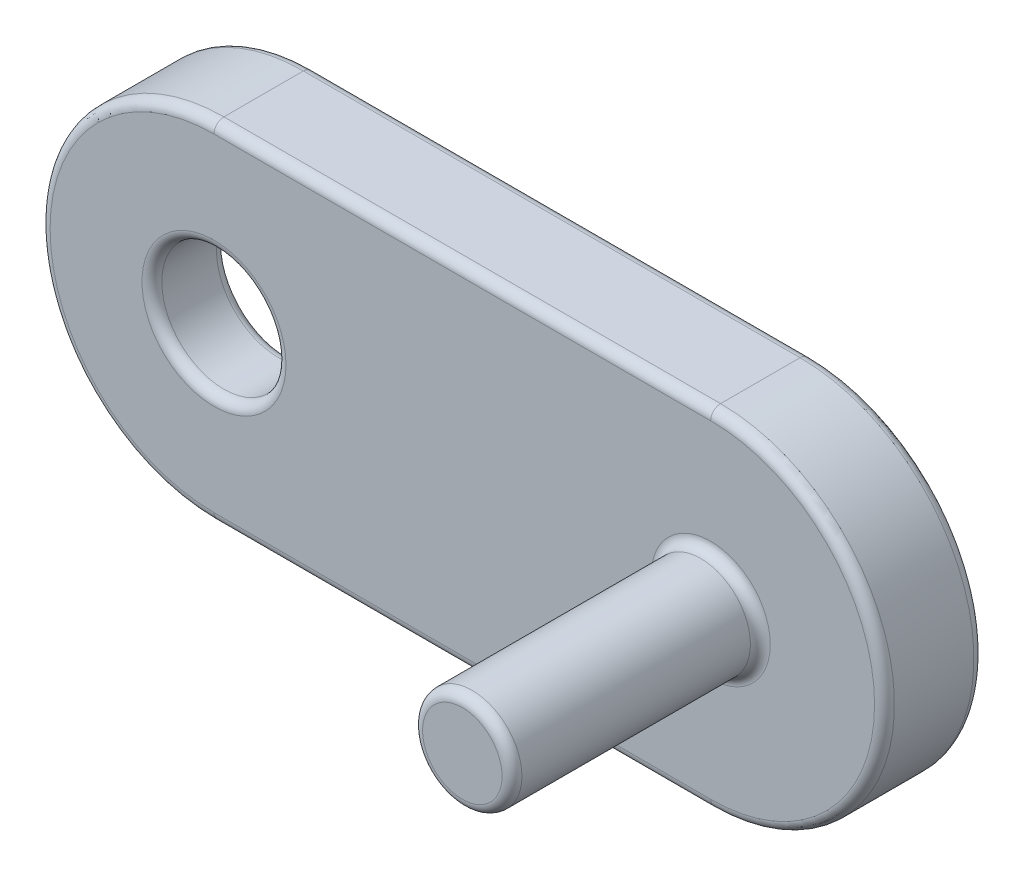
ISO-10303-21;
HEADER;
FILE_DESCRIPTION(('STEP AP214'),'2;1');
FILE_NAME('part.step','',(''),(''),'','','');
FILE_SCHEMA(('AUTOMOTIVE_DESIGN { 1 0 10303 214 1 1 1 1 }'));
ENDSEC;
DATA;
#1=APPLICATION_CONTEXT('core data for automotive mechanical design processes');
#2=APPLICATION_PROTOCOL_DEFINITION('international standard','automotive_design',2000,#1);
#3=PRODUCT_CONTEXT('',#1,'mechanical');
#4=PRODUCT('Part','Part','',(#3));
#5=PRODUCT_RELATED_PRODUCT_CATEGORY('part','',(#4));
#6=PRODUCT_DEFINITION_FORMATION('','',#4);
#7=PRODUCT_DEFINITION_CONTEXT('part definition',#1,'design');
#8=PRODUCT_DEFINITION('design','',#6,#7);
#9=PRODUCT_DEFINITION_SHAPE('','',#8);
#10=(LENGTH_UNIT() NAMED_UNIT(*) SI_UNIT(.MILLI.,.METRE.));
#11=(NAMED_UNIT(*) PLANE_ANGLE_UNIT() SI_UNIT($,.RADIAN.));
#12=(NAMED_UNIT(*) SI_UNIT($,.STERADIAN.) SOLID_ANGLE_UNIT());
#13=UNCERTAINTY_MEASURE_WITH_UNIT(LENGTH_MEASURE(1.E-05),#10,'distance_accuracy_value','');
#14=(GEOMETRIC_REPRESENTATION_CONTEXT(3) GLOBAL_UNCERTAINTY_ASSIGNED_CONTEXT((#13)) GLOBAL_UNIT_ASSIGNED_CONTEXT((#10,
#11,#12)) REPRESENTATION_CONTEXT('',''));
#15=CARTESIAN_POINT('',(0.,0.,0.));
#16=DIRECTION('',(0.,0.,1.));
#17=DIRECTION('',(1.,0.,0.));
#18=AXIS2_PLACEMENT_3D('',#15,#16,#17);
#19=CARTESIAN_POINT('',(-5.,0.,2.));
#20=DIRECTION('',(0.,0.,1.));
#21=DIRECTION('',(1.,0.,0.));
#22=AXIS2_PLACEMENT_3D('',#19,#20,#21);
#23=PLANE('',#22);
#24=CARTESIAN_POINT('',(-5.,0.,2.));
#25=DIRECTION('',(0.,0.,1.));
#26=DIRECTION('',(1.,0.,0.));
#27=AXIS2_PLACEMENT_3D('',#24,#25,#26);
#28=CIRCLE('',#27,1.45);
#29=CARTESIAN_POINT('',(-3.55,0.,2.));
#30=VERTEX_POINT('',#29);
#31=EDGE_CURVE('E243',#30,#30,#28,.F.);
#32=ORIENTED_EDGE('',*,*,#31,.T.);
#33=EDGE_LOOP('',(#32));
#34=FACE_BOUND('',#33,.T.);
#35=CARTESIAN_POINT('',(5.,0.,2.));
#36=DIRECTION('',(0.,0.,1.));
#37=DIRECTION('',(1.,0.,0.));
#38=AXIS2_PLACEMENT_3D('',#35,#36,#37);
#39=CIRCLE('',#38,3.3);
#40=CARTESIAN_POINT('',(5.,-3.3,2.));
#41=VERTEX_POINT('',#40);
#42=CARTESIAN_POINT('',(5.,3.3,2.));
#43=VERTEX_POINT('',#42);
#44=EDGE_CURVE('E46',#41,#43,#39,.T.);
#45=ORIENTED_EDGE('',*,*,#44,.T.);
#46=DIRECTION('',(-1.,0.,0.));
#47=VECTOR('',#46,1.);
#48=CARTESIAN_POINT('',(-5.,3.3,2.));
#49=LINE('',#48,#47);
#50=CARTESIAN_POINT('',(-5.,3.3,2.));
#51=VERTEX_POINT('',#50);
#52=EDGE_CURVE('E241',#43,#51,#49,.T.);
#53=ORIENTED_EDGE('',*,*,#52,.T.);
#54=CARTESIAN_POINT('',(-5.,0.,2.));
#55=DIRECTION('',(0.,0.,1.));
#56=DIRECTION('',(1.,0.,0.));
#57=AXIS2_PLACEMENT_3D('',#54,#55,#56);
#58=CIRCLE('',#57,3.3);
#59=CARTESIAN_POINT('',(-5.,-3.3,2.));
#60=VERTEX_POINT('',#59);
#61=EDGE_CURVE('E237',#51,#60,#58,.T.);
#62=ORIENTED_EDGE('',*,*,#61,.T.);
#63=DIRECTION('',(1.,0.,0.));
#64=VECTOR('',#63,1.);
#65=CARTESIAN_POINT('',(5.,-3.3,2.));
#66=LINE('',#65,#64);
#67=EDGE_CURVE('E51',#60,#41,#66,.T.);
#68=ORIENTED_EDGE('',*,*,#67,.T.);
#69=EDGE_LOOP('',(#45,#53,#62,#68));
#70=FACE_BOUND('',#69,.T.);
#71=CARTESIAN_POINT('',(5.,0.,2.));
#72=DIRECTION('',(0.,0.,1.));
#73=DIRECTION('',(1.,0.,0.));
#74=AXIS2_PLACEMENT_3D('',#71,#72,#73);
#75=CIRCLE('',#74,1.2);
#76=CARTESIAN_POINT('',(6.2,0.,2.));
#77=VERTEX_POINT('',#76);
#78=EDGE_CURVE('E234',#77,#77,#75,.F.);
#79=ORIENTED_EDGE('',*,*,#78,.T.);
#80=EDGE_LOOP('',(#79));
#81=FACE_BOUND('',#80,.T.);
#82=ADVANCED_FACE('F31',(#34,#70,#81),#23,.T.);
#83=CARTESIAN_POINT('',(-5.,0.,2.));
#84=DIRECTION('',(0.,0.,-1.));
#85=DIRECTION('',(-1.,0.,0.));
#86=AXIS2_PLACEMENT_3D('',#83,#84,#85);
#87=CYLINDRICAL_SURFACE('',#86,3.5);
#88=DIRECTION('',(0.,0.,-1.));
#89=VECTOR('',#88,1.);
#90=CARTESIAN_POINT('',(-5.,3.5,2.));
#91=LINE('',#90,#89);
#92=CARTESIAN_POINT('',(-5.,3.5,1.8));
#93=VERTEX_POINT('',#92);
#94=CARTESIAN_POINT('',(-5.,3.5,0.2));
#95=VERTEX_POINT('',#94);
#96=EDGE_CURVE('E332',#93,#95,#91,.T.);
#97=ORIENTED_EDGE('',*,*,#96,.T.);
#98=CARTESIAN_POINT('',(-5.,0.,0.2));
#99=DIRECTION('',(0.,0.,1.));
#100=DIRECTION('',(1.,0.,0.));
#101=AXIS2_PLACEMENT_3D('',#98,#99,#100);
#102=CIRCLE('',#101,3.5);
#103=CARTESIAN_POINT('',(-5.,-3.5,0.2));
#104=VERTEX_POINT('',#103);
#105=EDGE_CURVE('E232',#95,#104,#102,.T.);
#106=ORIENTED_EDGE('',*,*,#105,.T.);
#107=DIRECTION('',(0.,0.,-1.));
#108=VECTOR('',#107,1.);
#109=CARTESIAN_POINT('',(-5.,-3.5,2.));
#110=LINE('',#109,#108);
#111=CARTESIAN_POINT('',(-5.,-3.5,1.8));
#112=VERTEX_POINT('',#111);
#113=EDGE_CURVE('E295',#112,#104,#110,.T.);
#114=ORIENTED_EDGE('',*,*,#113,.F.);
#115=CARTESIAN_POINT('',(-5.,0.,1.8));
#116=DIRECTION('',(0.,0.,1.));
#117=DIRECTION('',(1.,0.,0.));
#118=AXIS2_PLACEMENT_3D('',#115,#116,#117);
#119=CIRCLE('',#118,3.5);
#120=EDGE_CURVE('E230',#112,#93,#119,.F.);
#121=ORIENTED_EDGE('',*,*,#120,.T.);
#122=EDGE_LOOP('',(#97,#106,#114,#121));
#123=FACE_BOUND('',#122,.T.);
#124=ADVANCED_FACE('F33',(#123),#87,.T.);
#125=CARTESIAN_POINT('',(-5.,-3.5,2.));
#126=DIRECTION('',(0.,1.,0.));
#127=DIRECTION('',(0.,0.,1.));
#128=AXIS2_PLACEMENT_3D('',#125,#126,#127);
#129=PLANE('',#128);
#130=ORIENTED_EDGE('',*,*,#113,.T.);
#131=DIRECTION('',(1.,0.,0.));
#132=VECTOR('',#131,1.);
#133=CARTESIAN_POINT('',(-5.,-3.5,0.2));
#134=LINE('',#133,#132);
#135=CARTESIAN_POINT('',(5.,-3.5,0.2));
#136=VERTEX_POINT('',#135);
#137=EDGE_CURVE('E200',#104,#136,#134,.T.);
#138=ORIENTED_EDGE('',*,*,#137,.T.);
#139=DIRECTION('',(0.,0.,-1.));
#140=VECTOR('',#139,1.);
#141=CARTESIAN_POINT('',(5.,-3.5,2.));
#142=LINE('',#141,#140);
#143=CARTESIAN_POINT('',(5.,-3.5,1.8));
#144=VERTEX_POINT('',#143);
#145=EDGE_CURVE('E302',#144,#136,#142,.T.);
#146=ORIENTED_EDGE('',*,*,#145,.F.);
#147=DIRECTION('',(1.,0.,0.));
#148=VECTOR('',#147,1.);
#149=CARTESIAN_POINT('',(-5.,-3.5,1.8));
#150=LINE('',#149,#148);
#151=EDGE_CURVE('E198',#144,#112,#150,.F.);
#152=ORIENTED_EDGE('',*,*,#151,.T.);
#153=EDGE_LOOP('',(#130,#138,#146,#152));
#154=FACE_BOUND('',#153,.T.);
#155=ADVANCED_FACE('F276',(#154),#129,.F.);
#156=CARTESIAN_POINT('',(5.,0.,2.));
#157=DIRECTION('',(0.,0.,-1.));
#158=DIRECTION('',(-1.,0.,0.));
#159=AXIS2_PLACEMENT_3D('',#156,#157,#158);
#160=CYLINDRICAL_SURFACE('',#159,3.5);
#161=ORIENTED_EDGE('',*,*,#145,.T.);
#162=CARTESIAN_POINT('',(5.,0.,0.2));
#163=DIRECTION('',(0.,0.,1.));
#164=DIRECTION('',(1.,0.,0.));
#165=AXIS2_PLACEMENT_3D('',#162,#163,#164);
#166=CIRCLE('',#165,3.5);
#167=CARTESIAN_POINT('',(5.,3.5,0.2));
#168=VERTEX_POINT('',#167);
#169=EDGE_CURVE('E223',#136,#168,#166,.T.);
#170=ORIENTED_EDGE('',*,*,#169,.T.);
#171=DIRECTION('',(0.,0.,-1.));
#172=VECTOR('',#171,1.);
#173=CARTESIAN_POINT('',(5.,3.5,2.));
#174=LINE('',#173,#172);
#175=CARTESIAN_POINT('',(5.,3.5,1.8));
#176=VERTEX_POINT('',#175);
#177=EDGE_CURVE('E327',#176,#168,#174,.T.);
#178=ORIENTED_EDGE('',*,*,#177,.F.);
#179=CARTESIAN_POINT('',(5.,0.,1.8));
#180=DIRECTION('',(0.,0.,1.));
#181=DIRECTION('',(1.,0.,0.));
#182=AXIS2_PLACEMENT_3D('',#179,#180,#181);
#183=CIRCLE('',#182,3.5);
#184=EDGE_CURVE('E221',#176,#144,#183,.F.);
#185=ORIENTED_EDGE('',*,*,#184,.T.);
#186=EDGE_LOOP('',(#161,#170,#178,#185));
#187=FACE_BOUND('',#186,.T.);
#188=ADVANCED_FACE('F285',(#187),#160,.T.);
#189=CARTESIAN_POINT('',(-5.,3.5,2.));
#190=DIRECTION('',(0.,-1.,0.));
#191=DIRECTION('',(0.,0.,-1.));
#192=AXIS2_PLACEMENT_3D('',#189,#190,#191);
#193=PLANE('',#192);
#194=ORIENTED_EDGE('',*,*,#177,.T.);
#195=DIRECTION('',(-1.,0.,0.));
#196=VECTOR('',#195,1.);
#197=CARTESIAN_POINT('',(-5.,3.5,0.2));
#198=LINE('',#197,#196);
#199=EDGE_CURVE('E228',#168,#95,#198,.T.);
#200=ORIENTED_EDGE('',*,*,#199,.T.);
#201=ORIENTED_EDGE('',*,*,#96,.F.);
#202=DIRECTION('',(-1.,0.,0.));
#203=VECTOR('',#202,1.);
#204=CARTESIAN_POINT('',(5.,3.5,1.8));
#205=LINE('',#204,#203);
#206=EDGE_CURVE('E225',#93,#176,#205,.F.);
#207=ORIENTED_EDGE('',*,*,#206,.T.);
#208=EDGE_LOOP('',(#194,#200,#201,#207));
#209=FACE_BOUND('',#208,.T.);
#210=ADVANCED_FACE('F282',(#209),#193,.F.);
#211=CARTESIAN_POINT('',(-5.,0.,0.));
#212=DIRECTION('',(0.,0.,1.));
#213=DIRECTION('',(1.,0.,0.));
#214=AXIS2_PLACEMENT_3D('',#211,#212,#213);
#215=PLANE('',#214);
#216=CARTESIAN_POINT('',(5.,0.,0.));
#217=DIRECTION('',(0.,0.,1.));
#218=DIRECTION('',(1.,0.,0.));
#219=AXIS2_PLACEMENT_3D('',#216,#217,#218);
#220=CIRCLE('',#219,3.3);
#221=CARTESIAN_POINT('',(5.,3.3,0.));
#222=VERTEX_POINT('',#221);
#223=CARTESIAN_POINT('',(5.,-3.3,0.));
#224=VERTEX_POINT('',#223);
#225=EDGE_CURVE('E216',#222,#224,#220,.F.);
#226=ORIENTED_EDGE('',*,*,#225,.T.);
#227=DIRECTION('',(1.,0.,0.));
#228=VECTOR('',#227,1.);
#229=CARTESIAN_POINT('',(-5.,-3.3,0.));
#230=LINE('',#229,#228);
#231=CARTESIAN_POINT('',(-5.,-3.3,0.));
#232=VERTEX_POINT('',#231);
#233=EDGE_CURVE('E218',#224,#232,#230,.F.);
#234=ORIENTED_EDGE('',*,*,#233,.T.);
#235=CARTESIAN_POINT('',(-5.,0.,0.));
#236=DIRECTION('',(0.,0.,1.));
#237=DIRECTION('',(1.,0.,0.));
#238=AXIS2_PLACEMENT_3D('',#235,#236,#237);
#239=CIRCLE('',#238,3.3);
#240=CARTESIAN_POINT('',(-5.,3.3,0.));
#241=VERTEX_POINT('',#240);
#242=EDGE_CURVE('E212',#232,#241,#239,.F.);
#243=ORIENTED_EDGE('',*,*,#242,.T.);
#244=DIRECTION('',(-1.,0.,0.));
#245=VECTOR('',#244,1.);
#246=CARTESIAN_POINT('',(-5.,3.3,0.));
#247=LINE('',#246,#245);
#248=EDGE_CURVE('E214',#241,#222,#247,.F.);
#249=ORIENTED_EDGE('',*,*,#248,.T.);
#250=EDGE_LOOP('',(#226,#234,#243,#249));
#251=FACE_BOUND('',#250,.T.);
#252=DIRECTION('',(-1.,0.,0.));
#253=VECTOR('',#252,1.);
#254=CARTESIAN_POINT('',(-5.,-3.2,0.));
#255=LINE('',#254,#253);
#256=CARTESIAN_POINT('',(-5.,-3.2,0.));
#257=VERTEX_POINT('',#256);
#258=CARTESIAN_POINT('',(5.,-3.2,0.));
#259=VERTEX_POINT('',#258);
#260=EDGE_CURVE('E207',#257,#259,#255,.F.);
#261=ORIENTED_EDGE('',*,*,#260,.T.);
#262=CARTESIAN_POINT('',(5.,0.,0.));
#263=DIRECTION('',(0.,0.,1.));
#264=DIRECTION('',(1.,0.,0.));
#265=AXIS2_PLACEMENT_3D('',#262,#263,#264);
#266=CIRCLE('',#265,3.2);
#267=CARTESIAN_POINT('',(5.,3.2,0.));
#268=VERTEX_POINT('',#267);
#269=EDGE_CURVE('E209',#259,#268,#266,.T.);
#270=ORIENTED_EDGE('',*,*,#269,.T.);
#271=DIRECTION('',(1.,0.,0.));
#272=VECTOR('',#271,1.);
#273=CARTESIAN_POINT('',(-5.,3.2,0.));
#274=LINE('',#273,#272);
#275=CARTESIAN_POINT('',(-5.,3.2,0.));
#276=VERTEX_POINT('',#275);
#277=EDGE_CURVE('E203',#268,#276,#274,.F.);
#278=ORIENTED_EDGE('',*,*,#277,.T.);
#279=CARTESIAN_POINT('',(-5.,0.,0.));
#280=DIRECTION('',(0.,0.,1.));
#281=DIRECTION('',(1.,0.,0.));
#282=AXIS2_PLACEMENT_3D('',#279,#280,#281);
#283=CIRCLE('',#282,3.2);
#284=EDGE_CURVE('E205',#276,#257,#283,.T.);
#285=ORIENTED_EDGE('',*,*,#284,.T.);
#286=EDGE_LOOP('',(#261,#270,#278,#285));
#287=FACE_BOUND('',#286,.T.);
#288=ADVANCED_FACE('F280',(#251,#287),#215,.F.);
#289=CARTESIAN_POINT('',(-5.,0.,0.5));
#290=DIRECTION('',(0.,0.,-1.));
#291=DIRECTION('',(-1.,0.,0.));
#292=AXIS2_PLACEMENT_3D('',#289,#290,#291);
#293=CYLINDRICAL_SURFACE('',#292,3.);
#294=DIRECTION('',(0.,0.,-1.));
#295=VECTOR('',#294,1.);
#296=CARTESIAN_POINT('',(-5.,3.,0.5));
#297=LINE('',#296,#295);
#298=CARTESIAN_POINT('',(-5.,3.,0.3));
#299=VERTEX_POINT('',#298);
#300=CARTESIAN_POINT('',(-5.,3.,0.2));
#301=VERTEX_POINT('',#300);
#302=EDGE_CURVE('E346',#299,#301,#297,.T.);
#303=ORIENTED_EDGE('',*,*,#302,.F.);
#304=CARTESIAN_POINT('',(-5.,0.,0.3));
#305=DIRECTION('',(0.,0.,-1.));
#306=DIRECTION('',(-1.,0.,0.));
#307=AXIS2_PLACEMENT_3D('',#304,#305,#306);
#308=CIRCLE('',#307,3.);
#309=CARTESIAN_POINT('',(-5.,-3.,0.3));
#310=VERTEX_POINT('',#309);
#311=EDGE_CURVE('E190',#299,#310,#308,.F.);
#312=ORIENTED_EDGE('',*,*,#311,.T.);
#313=DIRECTION('',(0.,0.,-1.));
#314=VECTOR('',#313,1.);
#315=CARTESIAN_POINT('',(-5.,-3.,0.5));
#316=LINE('',#315,#314);
#317=CARTESIAN_POINT('',(-5.,-3.,0.2));
#318=VERTEX_POINT('',#317);
#319=EDGE_CURVE('E347',#310,#318,#316,.T.);
#320=ORIENTED_EDGE('',*,*,#319,.T.);
#321=CARTESIAN_POINT('',(-5.,0.,0.2));
#322=DIRECTION('',(0.,0.,1.));
#323=DIRECTION('',(1.,0.,0.));
#324=AXIS2_PLACEMENT_3D('',#321,#322,#323);
#325=CIRCLE('',#324,3.);
#326=EDGE_CURVE('E188',#318,#301,#325,.F.);
#327=ORIENTED_EDGE('',*,*,#326,.T.);
#328=EDGE_LOOP('',(#303,#312,#320,#327));
#329=FACE_BOUND('',#328,.T.);
#330=ADVANCED_FACE('F396',(#329),#293,.F.);
#331=CARTESIAN_POINT('',(5.,-3.,0.5));
#332=DIRECTION('',(0.,-1.,0.));
#333=DIRECTION('',(1.,0.,0.));
#334=AXIS2_PLACEMENT_3D('',#331,#332,#333);
#335=PLANE('',#334);
#336=ORIENTED_EDGE('',*,*,#319,.F.);
#337=DIRECTION('',(-1.,0.,0.));
#338=VECTOR('',#337,1.);
#339=CARTESIAN_POINT('',(5.,-3.,0.3));
#340=LINE('',#339,#338);
#341=CARTESIAN_POINT('',(5.,-3.,0.3));
#342=VERTEX_POINT('',#341);
#343=EDGE_CURVE('E151',#310,#342,#340,.F.);
#344=ORIENTED_EDGE('',*,*,#343,.T.);
#345=DIRECTION('',(0.,0.,-1.));
#346=VECTOR('',#345,1.);
#347=CARTESIAN_POINT('',(5.,-3.,0.5));
#348=LINE('',#347,#346);
#349=CARTESIAN_POINT('',(5.,-3.,0.2));
#350=VERTEX_POINT('',#349);
#351=EDGE_CURVE('E350',#342,#350,#348,.T.);
#352=ORIENTED_EDGE('',*,*,#351,.T.);
#353=DIRECTION('',(-1.,0.,0.));
#354=VECTOR('',#353,1.);
#355=CARTESIAN_POINT('',(5.,-3.,0.2));
#356=LINE('',#355,#354);
#357=EDGE_CURVE('E172',#350,#318,#356,.T.);
#358=ORIENTED_EDGE('',*,*,#357,.T.);
#359=EDGE_LOOP('',(#336,#344,#352,#358));
#360=FACE_BOUND('',#359,.T.);
#361=ADVANCED_FACE('F373',(#360),#335,.F.);
#362=CARTESIAN_POINT('',(5.,0.,0.5));
#363=DIRECTION('',(0.,0.,-1.));
#364=DIRECTION('',(-1.,0.,0.));
#365=AXIS2_PLACEMENT_3D('',#362,#363,#364);
#366=CYLINDRICAL_SURFACE('',#365,3.);
#367=ORIENTED_EDGE('',*,*,#351,.F.);
#368=CARTESIAN_POINT('',(5.,0.,0.3));
#369=DIRECTION('',(0.,0.,-1.));
#370=DIRECTION('',(-1.,0.,0.));
#371=AXIS2_PLACEMENT_3D('',#368,#369,#370);
#372=CIRCLE('',#371,3.);
#373=CARTESIAN_POINT('',(5.,3.,0.3));
#374=VERTEX_POINT('',#373);
#375=EDGE_CURVE('E182',#342,#374,#372,.F.);
#376=ORIENTED_EDGE('',*,*,#375,.T.);
#377=DIRECTION('',(0.,0.,-1.));
#378=VECTOR('',#377,1.);
#379=CARTESIAN_POINT('',(5.,3.,0.5));
#380=LINE('',#379,#378);
#381=CARTESIAN_POINT('',(5.,3.,0.2));
#382=VERTEX_POINT('',#381);
#383=EDGE_CURVE('E353',#374,#382,#380,.T.);
#384=ORIENTED_EDGE('',*,*,#383,.T.);
#385=CARTESIAN_POINT('',(5.,0.,0.2));
#386=DIRECTION('',(0.,0.,1.));
#387=DIRECTION('',(1.,0.,0.));
#388=AXIS2_PLACEMENT_3D('',#385,#386,#387);
#389=CIRCLE('',#388,3.);
#390=EDGE_CURVE('E179',#382,#350,#389,.F.);
#391=ORIENTED_EDGE('',*,*,#390,.T.);
#392=EDGE_LOOP('',(#367,#376,#384,#391));
#393=FACE_BOUND('',#392,.T.);
#394=ADVANCED_FACE('F374',(#393),#366,.F.);
#395=CARTESIAN_POINT('',(-5.,3.,0.5));
#396=DIRECTION('',(0.,1.,0.));
#397=DIRECTION('',(0.,0.,1.));
#398=AXIS2_PLACEMENT_3D('',#395,#396,#397);
#399=PLANE('',#398);
#400=ORIENTED_EDGE('',*,*,#383,.F.);
#401=DIRECTION('',(1.,0.,0.));
#402=VECTOR('',#401,1.);
#403=CARTESIAN_POINT('',(-5.,3.,0.3));
#404=LINE('',#403,#402);
#405=EDGE_CURVE('E186',#374,#299,#404,.F.);
#406=ORIENTED_EDGE('',*,*,#405,.T.);
#407=ORIENTED_EDGE('',*,*,#302,.T.);
#408=DIRECTION('',(1.,0.,0.));
#409=VECTOR('',#408,1.);
#410=CARTESIAN_POINT('',(-5.,3.,0.2));
#411=LINE('',#410,#409);
#412=EDGE_CURVE('E184',#301,#382,#411,.T.);
#413=ORIENTED_EDGE('',*,*,#412,.T.);
#414=EDGE_LOOP('',(#400,#406,#407,#413));
#415=FACE_BOUND('',#414,.T.);
#416=ADVANCED_FACE('F407',(#415),#399,.F.);
#417=CARTESIAN_POINT('',(-5.,0.,0.5));
#418=DIRECTION('',(0.,0.,-1.));
#419=DIRECTION('',(-1.,0.,0.));
#420=AXIS2_PLACEMENT_3D('',#417,#418,#419);
#421=PLANE('',#420);
#422=CARTESIAN_POINT('',(5.,0.,0.5));
#423=DIRECTION('',(0.,0.,-1.));
#424=DIRECTION('',(-1.,0.,0.));
#425=AXIS2_PLACEMENT_3D('',#422,#423,#424);
#426=CIRCLE('',#425,2.8);
#427=CARTESIAN_POINT('',(5.,2.8,0.5));
#428=VERTEX_POINT('',#427);
#429=CARTESIAN_POINT('',(5.,-2.8,0.5));
#430=VERTEX_POINT('',#429);
#431=EDGE_CURVE('E170',#428,#430,#426,.T.);
#432=ORIENTED_EDGE('',*,*,#431,.T.);
#433=DIRECTION('',(-1.,0.,0.));
#434=VECTOR('',#433,1.);
#435=CARTESIAN_POINT('',(-5.,-2.8,0.5));
#436=LINE('',#435,#434);
#437=CARTESIAN_POINT('',(-5.,-2.8,0.5));
#438=VERTEX_POINT('',#437);
#439=EDGE_CURVE('E149',#430,#438,#436,.T.);
#440=ORIENTED_EDGE('',*,*,#439,.T.);
#441=CARTESIAN_POINT('',(-5.,0.,0.5));
#442=DIRECTION('',(0.,0.,-1.));
#443=DIRECTION('',(-1.,0.,0.));
#444=AXIS2_PLACEMENT_3D('',#441,#442,#443);
#445=CIRCLE('',#444,2.8);
#446=CARTESIAN_POINT('',(-5.,2.8,0.5));
#447=VERTEX_POINT('',#446);
#448=EDGE_CURVE('E158',#438,#447,#445,.T.);
#449=ORIENTED_EDGE('',*,*,#448,.T.);
#450=DIRECTION('',(1.,0.,0.));
#451=VECTOR('',#450,1.);
#452=CARTESIAN_POINT('',(-5.,2.8,0.5));
#453=LINE('',#452,#451);
#454=EDGE_CURVE('E164',#447,#428,#453,.T.);
#455=ORIENTED_EDGE('',*,*,#454,.T.);
#456=EDGE_LOOP('',(#432,#440,#449,#455));
#457=FACE_BOUND('',#456,.T.);
#458=CARTESIAN_POINT('',(-5.,0.,0.5));
#459=DIRECTION('',(0.,0.,-1.));
#460=DIRECTION('',(-1.,0.,0.));
#461=AXIS2_PLACEMENT_3D('',#458,#459,#460);
#462=CIRCLE('',#461,1.45);
#463=CARTESIAN_POINT('',(-6.45,0.,0.5));
#464=VERTEX_POINT('',#463);
#465=EDGE_CURVE('E165',#464,#464,#462,.F.);
#466=ORIENTED_EDGE('',*,*,#465,.T.);
#467=EDGE_LOOP('',(#466));
#468=FACE_BOUND('',#467,.T.);
#469=ADVANCED_FACE('F167',(#457,#468),#421,.T.);
#470=CARTESIAN_POINT('',(-5.,0.,2.));
#471=DIRECTION('',(0.,0.,-1.));
#472=DIRECTION('',(-1.,0.,0.));
#473=AXIS2_PLACEMENT_3D('',#470,#471,#472);
#474=CYLINDRICAL_SURFACE('',#473,1.25);
#475=CARTESIAN_POINT('',(-5.,0.,0.7));
#476=DIRECTION('',(0.,0.,-1.));
#477=DIRECTION('',(-1.,0.,0.));
#478=AXIS2_PLACEMENT_3D('',#475,#476,#477);
#479=CIRCLE('',#478,1.25);
#480=CARTESIAN_POINT('',(-6.25,0.,0.7));
#481=VERTEX_POINT('',#480);
#482=EDGE_CURVE('E195',#481,#481,#479,.T.);
#483=ORIENTED_EDGE('',*,*,#482,.T.);
#484=EDGE_LOOP('',(#483));
#485=FACE_BOUND('',#484,.T.);
#486=CARTESIAN_POINT('',(-5.,0.,1.8));
#487=DIRECTION('',(0.,0.,1.));
#488=DIRECTION('',(1.,0.,0.));
#489=AXIS2_PLACEMENT_3D('',#486,#487,#488);
#490=CIRCLE('',#489,1.25);
#491=CARTESIAN_POINT('',(-3.75,0.,1.8));
#492=VERTEX_POINT('',#491);
#493=EDGE_CURVE('E192',#492,#492,#490,.T.);
#494=ORIENTED_EDGE('',*,*,#493,.T.);
#495=EDGE_LOOP('',(#494));
#496=FACE_BOUND('',#495,.T.);
#497=ADVANCED_FACE('F414',(#485,#496),#474,.F.);
#498=CARTESIAN_POINT('',(5.,0.,7.));
#499=DIRECTION('',(0.,0.,-1.));
#500=DIRECTION('',(-1.,0.,0.));
#501=AXIS2_PLACEMENT_3D('',#498,#499,#500);
#502=CYLINDRICAL_SURFACE('',#501,1.);
#503=CARTESIAN_POINT('',(5.,0.,2.2));
#504=DIRECTION('',(0.,0.,1.));
#505=DIRECTION('',(1.,0.,0.));
#506=AXIS2_PLACEMENT_3D('',#503,#504,#505);
#507=CIRCLE('',#506,1.);
#508=CARTESIAN_POINT('',(6.,0.,2.2));
#509=VERTEX_POINT('',#508);
#510=EDGE_CURVE('E39',#509,#509,#507,.T.);
#511=ORIENTED_EDGE('',*,*,#510,.T.);
#512=EDGE_LOOP('',(#511));
#513=FACE_BOUND('',#512,.T.);
#514=CARTESIAN_POINT('',(5.,0.,6.8));
#515=DIRECTION('',(0.,0.,1.));
#516=DIRECTION('',(1.,0.,0.));
#517=AXIS2_PLACEMENT_3D('',#514,#515,#516);
#518=CIRCLE('',#517,1.);
#519=CARTESIAN_POINT('',(6.,0.,6.8));
#520=VERTEX_POINT('',#519);
#521=EDGE_CURVE('E246',#520,#520,#518,.F.);
#522=ORIENTED_EDGE('',*,*,#521,.T.);
#523=EDGE_LOOP('',(#522));
#524=FACE_BOUND('',#523,.T.);
#525=ADVANCED_FACE('F251',(#513,#524),#502,.T.);
#526=CARTESIAN_POINT('',(5.,0.,7.));
#527=DIRECTION('',(0.,0.,1.));
#528=DIRECTION('',(1.,0.,0.));
#529=AXIS2_PLACEMENT_3D('',#526,#527,#528);
#530=PLANE('',#529);
#531=CARTESIAN_POINT('',(5.,0.,7.));
#532=DIRECTION('',(0.,0.,1.));
#533=DIRECTION('',(1.,0.,0.));
#534=AXIS2_PLACEMENT_3D('',#531,#532,#533);
#535=CIRCLE('',#534,0.8);
#536=CARTESIAN_POINT('',(5.8,0.,7.));
#537=VERTEX_POINT('',#536);
#538=EDGE_CURVE('E11',#537,#537,#535,.T.);
#539=ORIENTED_EDGE('',*,*,#538,.T.);
#540=EDGE_LOOP('',(#539));
#541=FACE_BOUND('',#540,.T.);
#542=ADVANCED_FACE('F464',(#541),#530,.T.);
#543=CARTESIAN_POINT('',(-5.,2.8,0.3));
#544=DIRECTION('',(1.,0.,0.));
#545=DIRECTION('',(0.,0.,-1.));
#546=AXIS2_PLACEMENT_3D('',#543,#544,#545);
#547=CYLINDRICAL_SURFACE('',#546,0.2);
#548=CARTESIAN_POINT('',(-5.,2.8,0.3));
#549=DIRECTION('',(1.,0.,0.));
#550=DIRECTION('',(0.,0.,-1.));
#551=AXIS2_PLACEMENT_3D('',#548,#549,#550);
#552=CIRCLE('',#551,0.2);
#553=EDGE_CURVE('E161',#299,#447,#552,.T.);
#554=ORIENTED_EDGE('',*,*,#553,.F.);
#555=ORIENTED_EDGE('',*,*,#405,.F.);
#556=CARTESIAN_POINT('',(5.,2.8,0.3));
#557=DIRECTION('',(-1.,0.,0.));
#558=DIRECTION('',(0.,-1.,0.));
#559=AXIS2_PLACEMENT_3D('',#556,#557,#558);
#560=CIRCLE('',#559,0.2);
#561=EDGE_CURVE('E343',#428,#374,#560,.T.);
#562=ORIENTED_EDGE('',*,*,#561,.F.);
#563=ORIENTED_EDGE('',*,*,#454,.F.);
#564=EDGE_LOOP('',(#554,#555,#562,#563));
#565=FACE_BOUND('',#564,.T.);
#566=ADVANCED_FACE('F364',(#565),#547,.F.);
#567=CARTESIAN_POINT('',(5.,0.,0.3));
#568=DIRECTION('',(0.,0.,-1.));
#569=DIRECTION('',(-1.,0.,0.));
#570=AXIS2_PLACEMENT_3D('',#567,#568,#569);
#571=TOROIDAL_SURFACE('',#570,2.8,0.2);
#572=ORIENTED_EDGE('',*,*,#561,.T.);
#573=ORIENTED_EDGE('',*,*,#375,.F.);
#574=CARTESIAN_POINT('',(5.,-2.8,0.3));
#575=DIRECTION('',(1.,0.,0.));
#576=DIRECTION('',(0.,0.,-1.));
#577=AXIS2_PLACEMENT_3D('',#574,#575,#576);
#578=CIRCLE('',#577,0.2);
#579=EDGE_CURVE('E154',#430,#342,#578,.T.);
#580=ORIENTED_EDGE('',*,*,#579,.F.);
#581=ORIENTED_EDGE('',*,*,#431,.F.);
#582=EDGE_LOOP('',(#572,#573,#580,#581));
#583=FACE_BOUND('',#582,.T.);
#584=ADVANCED_FACE('F367',(#583),#571,.F.);
#585=CARTESIAN_POINT('',(-5.,0.,0.3));
#586=DIRECTION('',(0.,0.,-1.));
#587=DIRECTION('',(-1.,0.,0.));
#588=AXIS2_PLACEMENT_3D('',#585,#586,#587);
#589=TOROIDAL_SURFACE('',#588,2.8,0.2);
#590=ORIENTED_EDGE('',*,*,#553,.T.);
#591=ORIENTED_EDGE('',*,*,#448,.F.);
#592=CARTESIAN_POINT('',(-5.,-2.8,0.3));
#593=DIRECTION('',(-1.,0.,0.));
#594=DIRECTION('',(0.,0.,1.));
#595=AXIS2_PLACEMENT_3D('',#592,#593,#594);
#596=CIRCLE('',#595,0.2);
#597=EDGE_CURVE('E145',#310,#438,#596,.T.);
#598=ORIENTED_EDGE('',*,*,#597,.F.);
#599=ORIENTED_EDGE('',*,*,#311,.F.);
#600=EDGE_LOOP('',(#590,#591,#598,#599));
#601=FACE_BOUND('',#600,.T.);
#602=ADVANCED_FACE('F159',(#601),#589,.F.);
#603=CARTESIAN_POINT('',(-5.,-2.8,0.3));
#604=DIRECTION('',(-1.,0.,0.));
#605=DIRECTION('',(0.,-1.,0.));
#606=AXIS2_PLACEMENT_3D('',#603,#604,#605);
#607=CYLINDRICAL_SURFACE('',#606,0.2);
#608=ORIENTED_EDGE('',*,*,#579,.T.);
#609=ORIENTED_EDGE('',*,*,#343,.F.);
#610=ORIENTED_EDGE('',*,*,#597,.T.);
#611=ORIENTED_EDGE('',*,*,#439,.F.);
#612=EDGE_LOOP('',(#608,#609,#610,#611));
#613=FACE_BOUND('',#612,.T.);
#614=ADVANCED_FACE('F147',(#613),#607,.F.);
#615=CARTESIAN_POINT('',(-5.,0.,0.7));
#616=DIRECTION('',(0.,0.,-1.));
#617=DIRECTION('',(-1.,0.,0.));
#618=AXIS2_PLACEMENT_3D('',#615,#616,#617);
#619=TOROIDAL_SURFACE('',#618,1.45,0.2);
#620=ORIENTED_EDGE('',*,*,#465,.F.);
#621=EDGE_LOOP('',(#620));
#622=FACE_BOUND('',#621,.T.);
#623=ORIENTED_EDGE('',*,*,#482,.F.);
#624=EDGE_LOOP('',(#623));
#625=FACE_BOUND('',#624,.T.);
#626=ADVANCED_FACE('F501',(#622,#625),#619,.T.);
#627=CARTESIAN_POINT('',(-5.,3.3,0.2));
#628=DIRECTION('',(-1.,0.,0.));
#629=DIRECTION('',(0.,0.,1.));
#630=AXIS2_PLACEMENT_3D('',#627,#628,#629);
#631=CYLINDRICAL_SURFACE('',#630,0.2);
#632=CARTESIAN_POINT('',(5.,3.3,0.2));
#633=DIRECTION('',(1.,0.,0.));
#634=DIRECTION('',(0.,0.,-1.));
#635=AXIS2_PLACEMENT_3D('',#632,#633,#634);
#636=CIRCLE('',#635,0.2);
#637=EDGE_CURVE('E312',#222,#168,#636,.T.);
#638=ORIENTED_EDGE('',*,*,#637,.F.);
#639=ORIENTED_EDGE('',*,*,#248,.F.);
#640=CARTESIAN_POINT('',(-5.,3.3,0.2));
#641=DIRECTION('',(-1.,0.,0.));
#642=DIRECTION('',(0.,0.,1.));
#643=AXIS2_PLACEMENT_3D('',#640,#641,#642);
#644=CIRCLE('',#643,0.2);
#645=EDGE_CURVE('E155',#95,#241,#644,.T.);
#646=ORIENTED_EDGE('',*,*,#645,.F.);
#647=ORIENTED_EDGE('',*,*,#199,.F.);
#648=EDGE_LOOP('',(#638,#639,#646,#647));
#649=FACE_BOUND('',#648,.T.);
#650=ADVANCED_FACE('F336',(#649),#631,.T.);
#651=CARTESIAN_POINT('',(-5.,0.,0.2));
#652=DIRECTION('',(0.,0.,1.));
#653=DIRECTION('',(1.,0.,0.));
#654=AXIS2_PLACEMENT_3D('',#651,#652,#653);
#655=TOROIDAL_SURFACE('',#654,3.3,0.2);
#656=ORIENTED_EDGE('',*,*,#645,.T.);
#657=ORIENTED_EDGE('',*,*,#242,.F.);
#658=CARTESIAN_POINT('',(-5.,-3.3,0.2));
#659=DIRECTION('',(1.,0.,0.));
#660=DIRECTION('',(0.,0.,-1.));
#661=AXIS2_PLACEMENT_3D('',#658,#659,#660);
#662=CIRCLE('',#661,0.2);
#663=EDGE_CURVE('E307',#104,#232,#662,.T.);
#664=ORIENTED_EDGE('',*,*,#663,.F.);
#665=ORIENTED_EDGE('',*,*,#105,.F.);
#666=EDGE_LOOP('',(#656,#657,#664,#665));
#667=FACE_BOUND('',#666,.T.);
#668=ADVANCED_FACE('F309',(#667),#655,.T.);
#669=CARTESIAN_POINT('',(5.,0.,0.2));
#670=DIRECTION('',(0.,0.,1.));
#671=DIRECTION('',(1.,0.,0.));
#672=AXIS2_PLACEMENT_3D('',#669,#670,#671);
#673=TOROIDAL_SURFACE('',#672,3.3,0.2);
#674=ORIENTED_EDGE('',*,*,#637,.T.);
#675=ORIENTED_EDGE('',*,*,#169,.F.);
#676=CARTESIAN_POINT('',(5.,-3.3,0.2));
#677=DIRECTION('',(-1.,0.,0.));
#678=DIRECTION('',(0.,0.,1.));
#679=AXIS2_PLACEMENT_3D('',#676,#677,#678);
#680=CIRCLE('',#679,0.2);
#681=EDGE_CURVE('E313',#224,#136,#680,.T.);
#682=ORIENTED_EDGE('',*,*,#681,.F.);
#683=ORIENTED_EDGE('',*,*,#225,.F.);
#684=EDGE_LOOP('',(#674,#675,#682,#683));
#685=FACE_BOUND('',#684,.T.);
#686=ADVANCED_FACE('F323',(#685),#673,.T.);
#687=CARTESIAN_POINT('',(-5.,-3.3,0.2));
#688=DIRECTION('',(1.,0.,0.));
#689=DIRECTION('',(0.,0.,-1.));
#690=AXIS2_PLACEMENT_3D('',#687,#688,#689);
#691=CYLINDRICAL_SURFACE('',#690,0.2);
#692=ORIENTED_EDGE('',*,*,#663,.T.);
#693=ORIENTED_EDGE('',*,*,#233,.F.);
#694=ORIENTED_EDGE('',*,*,#681,.T.);
#695=ORIENTED_EDGE('',*,*,#137,.F.);
#696=EDGE_LOOP('',(#692,#693,#694,#695));
#697=FACE_BOUND('',#696,.T.);
#698=ADVANCED_FACE('F315',(#697),#691,.T.);
#699=CARTESIAN_POINT('',(-5.,0.,0.2));
#700=DIRECTION('',(0.,0.,1.));
#701=DIRECTION('',(1.,0.,0.));
#702=AXIS2_PLACEMENT_3D('',#699,#700,#701);
#703=TOROIDAL_SURFACE('',#702,3.2,0.2);
#704=CARTESIAN_POINT('',(-5.,-3.2,0.2));
#705=DIRECTION('',(1.,0.,0.));
#706=DIRECTION('',(0.,0.,-1.));
#707=AXIS2_PLACEMENT_3D('',#704,#705,#706);
#708=CIRCLE('',#707,0.2);
#709=EDGE_CURVE('E392',#257,#318,#708,.T.);
#710=ORIENTED_EDGE('',*,*,#709,.F.);
#711=ORIENTED_EDGE('',*,*,#284,.F.);
#712=CARTESIAN_POINT('',(-5.,3.2,0.2));
#713=DIRECTION('',(1.,0.,0.));
#714=DIRECTION('',(0.,0.,-1.));
#715=AXIS2_PLACEMENT_3D('',#712,#713,#714);
#716=CIRCLE('',#715,0.2);
#717=EDGE_CURVE('E320',#301,#276,#716,.T.);
#718=ORIENTED_EDGE('',*,*,#717,.F.);
#719=ORIENTED_EDGE('',*,*,#326,.F.);
#720=EDGE_LOOP('',(#710,#711,#718,#719));
#721=FACE_BOUND('',#720,.T.);
#722=ADVANCED_FACE('F399',(#721),#703,.T.);
#723=CARTESIAN_POINT('',(-5.,3.2,0.2));
#724=DIRECTION('',(1.,0.,0.));
#725=DIRECTION('',(0.,0.,-1.));
#726=AXIS2_PLACEMENT_3D('',#723,#724,#725);
#727=CYLINDRICAL_SURFACE('',#726,0.2);
#728=ORIENTED_EDGE('',*,*,#717,.T.);
#729=ORIENTED_EDGE('',*,*,#277,.F.);
#730=CARTESIAN_POINT('',(5.,3.2,0.2));
#731=DIRECTION('',(1.,0.,0.));
#732=DIRECTION('',(0.,0.,-1.));
#733=AXIS2_PLACEMENT_3D('',#730,#731,#732);
#734=CIRCLE('',#733,0.2);
#735=EDGE_CURVE('E380',#382,#268,#734,.T.);
#736=ORIENTED_EDGE('',*,*,#735,.F.);
#737=ORIENTED_EDGE('',*,*,#412,.F.);
#738=EDGE_LOOP('',(#728,#729,#736,#737));
#739=FACE_BOUND('',#738,.T.);
#740=ADVANCED_FACE('F405',(#739),#727,.T.);
#741=CARTESIAN_POINT('',(5.,-3.2,0.2));
#742=DIRECTION('',(-1.,0.,0.));
#743=DIRECTION('',(0.,-1.,0.));
#744=AXIS2_PLACEMENT_3D('',#741,#742,#743);
#745=CYLINDRICAL_SURFACE('',#744,0.2);
#746=ORIENTED_EDGE('',*,*,#709,.T.);
#747=ORIENTED_EDGE('',*,*,#357,.F.);
#748=CARTESIAN_POINT('',(5.,-3.2,0.2));
#749=DIRECTION('',(1.,0.,0.));
#750=DIRECTION('',(0.,0.,-1.));
#751=AXIS2_PLACEMENT_3D('',#748,#749,#750);
#752=CIRCLE('',#751,0.2);
#753=EDGE_CURVE('E383',#259,#350,#752,.T.);
#754=ORIENTED_EDGE('',*,*,#753,.F.);
#755=ORIENTED_EDGE('',*,*,#260,.F.);
#756=EDGE_LOOP('',(#746,#747,#754,#755));
#757=FACE_BOUND('',#756,.T.);
#758=ADVANCED_FACE('F390',(#757),#745,.T.);
#759=CARTESIAN_POINT('',(5.,0.,0.2));
#760=DIRECTION('',(0.,0.,1.));
#761=DIRECTION('',(1.,0.,0.));
#762=AXIS2_PLACEMENT_3D('',#759,#760,#761);
#763=TOROIDAL_SURFACE('',#762,3.2,0.2);
#764=ORIENTED_EDGE('',*,*,#735,.T.);
#765=ORIENTED_EDGE('',*,*,#269,.F.);
#766=ORIENTED_EDGE('',*,*,#753,.T.);
#767=ORIENTED_EDGE('',*,*,#390,.F.);
#768=EDGE_LOOP('',(#764,#765,#766,#767));
#769=FACE_BOUND('',#768,.T.);
#770=ADVANCED_FACE('F378',(#769),#763,.T.);
#771=CARTESIAN_POINT('',(-5.,0.,1.8));
#772=DIRECTION('',(0.,0.,1.));
#773=DIRECTION('',(1.,0.,0.));
#774=AXIS2_PLACEMENT_3D('',#771,#772,#773);
#775=TOROIDAL_SURFACE('',#774,1.45,0.2);
#776=ORIENTED_EDGE('',*,*,#493,.F.);
#777=EDGE_LOOP('',(#776));
#778=FACE_BOUND('',#777,.T.);
#779=ORIENTED_EDGE('',*,*,#31,.F.);
#780=EDGE_LOOP('',(#779));
#781=FACE_BOUND('',#780,.T.);
#782=ADVANCED_FACE('F566',(#778,#781),#775,.T.);
#783=CARTESIAN_POINT('',(-5.,-3.3,1.8));
#784=DIRECTION('',(-1.,0.,0.));
#785=DIRECTION('',(0.,0.,1.));
#786=AXIS2_PLACEMENT_3D('',#783,#784,#785);
#787=CYLINDRICAL_SURFACE('',#786,0.2);
#788=CARTESIAN_POINT('',(-5.,-3.3,1.8));
#789=DIRECTION('',(-1.,0.,0.));
#790=DIRECTION('',(0.,0.,1.));
#791=AXIS2_PLACEMENT_3D('',#788,#789,#790);
#792=CIRCLE('',#791,0.2);
#793=EDGE_CURVE('E680',#112,#60,#792,.T.);
#794=ORIENTED_EDGE('',*,*,#793,.F.);
#795=ORIENTED_EDGE('',*,*,#151,.F.);
#796=CARTESIAN_POINT('',(5.,-3.3,1.8));
#797=DIRECTION('',(1.,0.,0.));
#798=DIRECTION('',(0.,0.,-1.));
#799=AXIS2_PLACEMENT_3D('',#796,#797,#798);
#800=CIRCLE('',#799,0.2);
#801=EDGE_CURVE('E387',#41,#144,#800,.T.);
#802=ORIENTED_EDGE('',*,*,#801,.F.);
#803=ORIENTED_EDGE('',*,*,#67,.F.);
#804=EDGE_LOOP('',(#794,#795,#802,#803));
#805=FACE_BOUND('',#804,.T.);
#806=ADVANCED_FACE('F574',(#805),#787,.T.);
#807=CARTESIAN_POINT('',(5.,0.,1.8));
#808=DIRECTION('',(0.,0.,1.));
#809=DIRECTION('',(1.,0.,0.));
#810=AXIS2_PLACEMENT_3D('',#807,#808,#809);
#811=TOROIDAL_SURFACE('',#810,3.3,0.2);
#812=ORIENTED_EDGE('',*,*,#801,.T.);
#813=ORIENTED_EDGE('',*,*,#184,.F.);
#814=CARTESIAN_POINT('',(5.,3.3,1.8));
#815=DIRECTION('',(-1.,0.,0.));
#816=DIRECTION('',(0.,0.,1.));
#817=AXIS2_PLACEMENT_3D('',#814,#815,#816);
#818=CIRCLE('',#817,0.2);
#819=EDGE_CURVE('E682',#43,#176,#818,.T.);
#820=ORIENTED_EDGE('',*,*,#819,.F.);
#821=ORIENTED_EDGE('',*,*,#44,.F.);
#822=EDGE_LOOP('',(#812,#813,#820,#821));
#823=FACE_BOUND('',#822,.T.);
#824=ADVANCED_FACE('F583',(#823),#811,.T.);
#825=CARTESIAN_POINT('',(-5.,0.,1.8));
#826=DIRECTION('',(0.,0.,1.));
#827=DIRECTION('',(1.,0.,0.));
#828=AXIS2_PLACEMENT_3D('',#825,#826,#827);
#829=TOROIDAL_SURFACE('',#828,3.3,0.2);
#830=ORIENTED_EDGE('',*,*,#793,.T.);
#831=ORIENTED_EDGE('',*,*,#61,.F.);
#832=CARTESIAN_POINT('',(-5.,3.3,1.8));
#833=DIRECTION('',(1.,0.,0.));
#834=DIRECTION('',(0.,0.,-1.));
#835=AXIS2_PLACEMENT_3D('',#832,#833,#834);
#836=CIRCLE('',#835,0.2);
#837=EDGE_CURVE('E686',#93,#51,#836,.T.);
#838=ORIENTED_EDGE('',*,*,#837,.F.);
#839=ORIENTED_EDGE('',*,*,#120,.F.);
#840=EDGE_LOOP('',(#830,#831,#838,#839));
#841=FACE_BOUND('',#840,.T.);
#842=ADVANCED_FACE('F266',(#841),#829,.T.);
#843=CARTESIAN_POINT('',(-5.,3.3,1.8));
#844=DIRECTION('',(1.,0.,0.));
#845=DIRECTION('',(0.,0.,-1.));
#846=AXIS2_PLACEMENT_3D('',#843,#844,#845);
#847=CYLINDRICAL_SURFACE('',#846,0.2);
#848=ORIENTED_EDGE('',*,*,#819,.T.);
#849=ORIENTED_EDGE('',*,*,#206,.F.);
#850=ORIENTED_EDGE('',*,*,#837,.T.);
#851=ORIENTED_EDGE('',*,*,#52,.F.);
#852=EDGE_LOOP('',(#848,#849,#850,#851));
#853=FACE_BOUND('',#852,.T.);
#854=ADVANCED_FACE('F257',(#853),#847,.T.);
#855=CARTESIAN_POINT('',(5.,0.,2.2));
#856=DIRECTION('',(0.,0.,1.));
#857=DIRECTION('',(1.,0.,0.));
#858=AXIS2_PLACEMENT_3D('',#855,#856,#857);
#859=TOROIDAL_SURFACE('',#858,1.2,0.2);
#860=ORIENTED_EDGE('',*,*,#78,.F.);
#861=EDGE_LOOP('',(#860));
#862=FACE_BOUND('',#861,.T.);
#863=ORIENTED_EDGE('',*,*,#510,.F.);
#864=EDGE_LOOP('',(#863));
#865=FACE_BOUND('',#864,.T.);
#866=ADVANCED_FACE('F254',(#862,#865),#859,.F.);
#867=CARTESIAN_POINT('',(5.,0.,6.8));
#868=DIRECTION('',(0.,0.,1.));
#869=DIRECTION('',(1.,0.,0.));
#870=AXIS2_PLACEMENT_3D('',#867,#868,#869);
#871=TOROIDAL_SURFACE('',#870,0.8,0.2);
#872=ORIENTED_EDGE('',*,*,#521,.F.);
#873=EDGE_LOOP('',(#872));
#874=FACE_BOUND('',#873,.T.);
#875=ORIENTED_EDGE('',*,*,#538,.F.);
#876=EDGE_LOOP('',(#875));
#877=FACE_BOUND('',#876,.T.);
#878=ADVANCED_FACE('F256',(#874,#877),#871,.T.);
#879=CLOSED_SHELL('',(#82,#124,#155,#188,#210,#288,#330,#361,#394,#416,#469,#497,#525,#542,#566,
#584,#602,#614,#626,#650,#668,#686,#698,#722,#740,#758,#770,#782,#806,#824,#842,#854,#866,#878));
#880=MANIFOLD_SOLID_BREP('B2',#879);
#881=ADVANCED_BREP_SHAPE_REPRESENTATION('',(#18,#880),#14);
#882=SHAPE_DEFINITION_REPRESENTATION(#9,#881);
ENDSEC;
END-ISO-10303-21;
